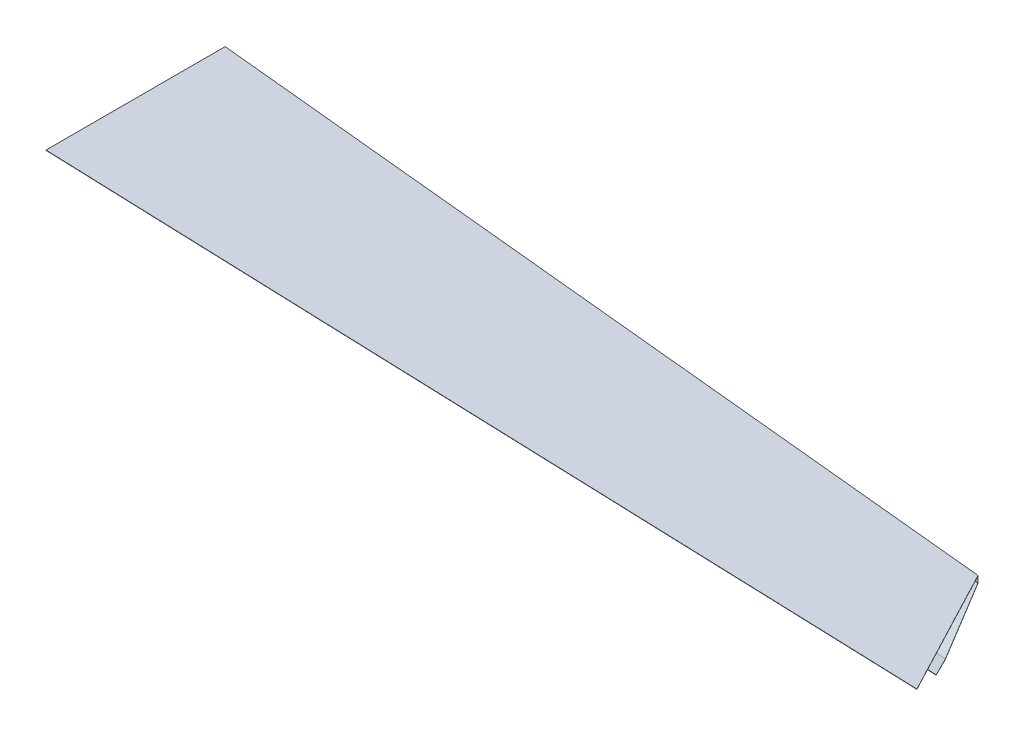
ISO-10303-21;
HEADER;
FILE_DESCRIPTION(('STEP AP214'),'2;1');
FILE_NAME('part.step','',(''),(''),'','','');
FILE_SCHEMA(('AUTOMOTIVE_DESIGN { 1 0 10303 214 1 1 1 1 }'));
ENDSEC;
DATA;
#1=APPLICATION_CONTEXT('core data for automotive mechanical design processes');
#2=APPLICATION_PROTOCOL_DEFINITION('international standard','automotive_design',2000,#1);
#3=PRODUCT_CONTEXT('',#1,'mechanical');
#4=PRODUCT('Part','Part','',(#3));
#5=PRODUCT_RELATED_PRODUCT_CATEGORY('part','',(#4));
#6=PRODUCT_DEFINITION_FORMATION('','',#4);
#7=PRODUCT_DEFINITION_CONTEXT('part definition',#1,'design');
#8=PRODUCT_DEFINITION('design','',#6,#7);
#9=PRODUCT_DEFINITION_SHAPE('','',#8);
#10=(LENGTH_UNIT() NAMED_UNIT(*) SI_UNIT(.MILLI.,.METRE.));
#11=(NAMED_UNIT(*) PLANE_ANGLE_UNIT() SI_UNIT($,.RADIAN.));
#12=(NAMED_UNIT(*) SI_UNIT($,.STERADIAN.) SOLID_ANGLE_UNIT());
#13=UNCERTAINTY_MEASURE_WITH_UNIT(LENGTH_MEASURE(1.E-05),#10,'distance_accuracy_value','');
#14=(GEOMETRIC_REPRESENTATION_CONTEXT(3) GLOBAL_UNCERTAINTY_ASSIGNED_CONTEXT((#13)) GLOBAL_UNIT_ASSIGNED_CONTEXT((#10,
#11,#12)) REPRESENTATION_CONTEXT('',''));
#15=CARTESIAN_POINT('',(0.,0.,0.));
#16=DIRECTION('',(0.,0.,1.));
#17=DIRECTION('',(1.,0.,0.));
#18=AXIS2_PLACEMENT_3D('',#15,#16,#17);
#19=CARTESIAN_POINT('',(-2552.7,0.,1.09982839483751E-12));
#20=DIRECTION('',(-1.,0.,0.));
#21=DIRECTION('',(0.,0.,1.));
#22=AXIS2_PLACEMENT_3D('',#19,#20,#21);
#23=PLANE('',#22);
#24=DIRECTION('',(0.,0.201372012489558,-0.979514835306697));
#25=VECTOR('',#24,1.);
#26=CARTESIAN_POINT('',(-2552.7,-349.90529063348,-71.9347272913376));
#27=LINE('',#26,#25);
#28=CARTESIAN_POINT('',(-2552.7,-161.69252197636,-987.44029737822));
#29=VERTEX_POINT('',#28);
#30=CARTESIAN_POINT('',(-2552.7,-38.1,-1588.61971308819));
#31=VERTEX_POINT('',#30);
#32=EDGE_CURVE('E219',#29,#31,#27,.T.);
#33=ORIENTED_EDGE('',*,*,#32,.F.);
#34=DIRECTION('',(0.,0.0535365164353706,0.998565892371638));
#35=VECTOR('',#34,1.);
#36=CARTESIAN_POINT('',(-2552.7,-108.44078468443,5.81387958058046));
#37=LINE('',#36,#35);
#38=CARTESIAN_POINT('',(-2552.7,-158.848765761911,-934.398408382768));
#39=VERTEX_POINT('',#38);
#40=EDGE_CURVE('E199',#29,#39,#37,.T.);
#41=ORIENTED_EDGE('',*,*,#40,.T.);
#42=DIRECTION('',(0.,0.998589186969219,-0.0531002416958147));
#43=VECTOR('',#42,1.);
#44=CARTESIAN_POINT('',(-2552.7,-123.400309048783,-936.283389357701));
#45=LINE('',#44,#43);
#46=CARTESIAN_POINT('',(-2552.7,-157.225418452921,-934.484730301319));
#47=VERTEX_POINT('',#46);
#48=EDGE_CURVE('E196',#39,#47,#45,.T.);
#49=ORIENTED_EDGE('',*,*,#48,.T.);
#50=DIRECTION('',(0.,0.0535365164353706,0.998565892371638));
#51=VECTOR('',#50,1.);
#52=CARTESIAN_POINT('',(-2552.7,-106.817475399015,5.72684844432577));
#53=LINE('',#52,#51);
#54=CARTESIAN_POINT('',(-2552.7,-160.057939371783,-987.317057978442));
#55=VERTEX_POINT('',#54);
#56=EDGE_CURVE('E226',#55,#47,#53,.T.);
#57=ORIENTED_EDGE('',*,*,#56,.F.);
#58=DIRECTION('',(0.,0.201372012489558,-0.979514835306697));
#59=VECTOR('',#58,1.);
#60=CARTESIAN_POINT('',(-2552.7,-348.312682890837,-71.6073135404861));
#61=LINE('',#60,#59);
#62=CARTESIAN_POINT('',(-2552.7,-36.7758705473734,-1586.98636578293));
#63=VERTEX_POINT('',#62);
#64=EDGE_CURVE('E190',#55,#63,#61,.T.);
#65=ORIENTED_EDGE('',*,*,#64,.T.);
#66=DIRECTION('',(0.,1.,0.));
#67=VECTOR('',#66,1.);
#68=CARTESIAN_POINT('',(-2552.7,-19.0500000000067,-1586.98636578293));
#69=LINE('',#68,#67);
#70=CARTESIAN_POINT('',(-2552.7,-1.62560000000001,-1586.98636578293));
#71=VERTEX_POINT('',#70);
#72=EDGE_CURVE('E174',#63,#71,#69,.T.);
#73=ORIENTED_EDGE('',*,*,#72,.T.);
#74=DIRECTION('',(0.,0.,1.));
#75=VECTOR('',#74,1.);
#76=CARTESIAN_POINT('',(-2552.7,-1.62560000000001,1.09982839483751E-12));
#77=LINE('',#76,#75);
#78=CARTESIAN_POINT('',(-2552.7,-1.62560000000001,-576.950850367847));
#79=VERTEX_POINT('',#78);
#80=EDGE_CURVE('E188',#71,#79,#77,.T.);
#81=ORIENTED_EDGE('',*,*,#80,.T.);
#82=DIRECTION('',(0.,-1.,0.));
#83=VECTOR('',#82,1.);
#84=CARTESIAN_POINT('',(-2552.7,-1.62559999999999,-576.950850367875));
#85=LINE('',#84,#83);
#86=CARTESIAN_POINT('',(-2552.7,0.,-576.950850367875));
#87=VERTEX_POINT('',#86);
#88=EDGE_CURVE('E191',#87,#79,#85,.T.);
#89=ORIENTED_EDGE('',*,*,#88,.F.);
#90=DIRECTION('',(0.,0.,1.));
#91=VECTOR('',#90,1.);
#92=CARTESIAN_POINT('',(-2552.7,0.,1.09982839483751E-12));
#93=LINE('',#92,#91);
#94=CARTESIAN_POINT('',(-2552.7,0.,-1588.61971308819));
#95=VERTEX_POINT('',#94);
#96=EDGE_CURVE('E228',#95,#87,#93,.T.);
#97=ORIENTED_EDGE('',*,*,#96,.F.);
#98=DIRECTION('',(0.,1.,0.));
#99=VECTOR('',#98,1.);
#100=CARTESIAN_POINT('',(-2552.7,-1.62560000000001,-1588.61971308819));
#101=LINE('',#100,#99);
#102=EDGE_CURVE('E232',#31,#95,#101,.T.);
#103=ORIENTED_EDGE('',*,*,#102,.F.);
#104=EDGE_LOOP('',(#33,#41,#49,#57,#65,#73,#81,#89,#97,#103));
#105=FACE_BOUND('',#104,.T.);
#106=ADVANCED_FACE('F90',(#105),#23,.T.);
#107=CARTESIAN_POINT('',(2571.71966629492,-1.62559999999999,-398.82639715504));
#108=DIRECTION('',(-0.0347389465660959,0.,0.999396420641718));
#109=DIRECTION('',(0.999396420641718,0.,0.0347389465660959));
#110=AXIS2_PLACEMENT_3D('',#107,#108,#109);
#111=PLANE('',#110);
#112=DIRECTION('',(0.999396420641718,0.,0.0347389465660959));
#113=VECTOR('',#112,1.);
#114=CARTESIAN_POINT('',(2571.71966629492,0.,-398.82639715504));
#115=LINE('',#114,#113);
#116=CARTESIAN_POINT('',(2542.48326093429,0.,-399.842652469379));
#117=VERTEX_POINT('',#116);
#118=EDGE_CURVE('E182',#87,#117,#115,.T.);
#119=ORIENTED_EDGE('',*,*,#118,.F.);
#120=ORIENTED_EDGE('',*,*,#88,.T.);
#121=DIRECTION('',(0.999396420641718,0.,0.0347389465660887));
#122=VECTOR('',#121,1.);
#123=CARTESIAN_POINT('',(-2552.7,-1.62560000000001,-576.950850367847));
#124=LINE('',#123,#122);
#125=CARTESIAN_POINT('',(2542.48326093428,-1.62559999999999,-399.842652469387));
#126=VERTEX_POINT('',#125);
#127=EDGE_CURVE('E194',#79,#126,#124,.T.);
#128=ORIENTED_EDGE('',*,*,#127,.T.);
#129=DIRECTION('',(0.,-1.,0.));
#130=VECTOR('',#129,1.);
#131=CARTESIAN_POINT('',(2542.48326093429,-1.62559999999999,-399.842652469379));
#132=LINE('',#131,#130);
#133=EDGE_CURVE('E255',#117,#126,#132,.T.);
#134=ORIENTED_EDGE('',*,*,#133,.F.);
#135=EDGE_LOOP('',(#119,#120,#128,#134));
#136=FACE_BOUND('',#135,.T.);
#137=ADVANCED_FACE('F241',(#136),#111,.T.);
#138=CARTESIAN_POINT('',(-2578.1,0.,-1591.10246902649));
#139=CARTESIAN_POINT('',(-2578.1,-12.7,-1591.10246902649));
#140=CARTESIAN_POINT('',(-2578.1,-25.4,-1591.10246902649));
#141=CARTESIAN_POINT('',(-2578.1,-38.1,-1591.10246902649));
#142=CARTESIAN_POINT('',(-988.874596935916,0.,-1435.76157112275));
#143=CARTESIAN_POINT('',(-988.874596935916,-12.7,-1435.76157112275));
#144=CARTESIAN_POINT('',(-988.874596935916,-25.4,-1435.76157112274));
#145=CARTESIAN_POINT('',(-988.874596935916,-38.1,-1435.76157112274));
#146=CARTESIAN_POINT('',(600.35080612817,0.,-1280.420673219));
#147=CARTESIAN_POINT('',(600.35080612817,-12.7,-1280.420673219));
#148=CARTESIAN_POINT('',(600.35080612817,-25.4,-1280.420673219));
#149=CARTESIAN_POINT('',(600.35080612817,-38.1,-1280.420673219));
#150=CARTESIAN_POINT('',(2189.57620919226,0.,-1125.07977531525));
#151=CARTESIAN_POINT('',(2189.57620919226,-12.7,-1125.07977531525));
#152=CARTESIAN_POINT('',(2189.57620919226,-25.4,-1125.07977531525));
#153=CARTESIAN_POINT('',(2189.57620919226,-38.1000000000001,-1125.07977531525));
#154=B_SPLINE_SURFACE_WITH_KNOTS('',3,3,((#138,#139,#140,#141),(#142,#143,#144,#145),(#146,#147,
#148,#149),(#150,#151,#152,#153)),.UNSPECIFIED.,.F.,.F.,.F.,(4,4),(4,4),(0.,1.),(0.,1.),.UNSPECIFIED.);
#155=OFFSET_SURFACE('',#154,-1.6256,.F.);
#156=ORIENTED_EDGE('',*,*,#72,.F.);
#157=DIRECTION('',(-0.995256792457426,0.,-0.0972826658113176));
#158=VECTOR('',#157,1.);
#159=CARTESIAN_POINT('',(-194.420038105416,-36.7758705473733,-1356.47323272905));
#160=LINE('',#159,#158);
#161=CARTESIAN_POINT('',(2160.22434111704,-36.7758705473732,-1126.31546441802));
#162=VERTEX_POINT('',#161);
#163=EDGE_CURVE('E205',#162,#63,#160,.T.);
#164=ORIENTED_EDGE('',*,*,#163,.F.);
#165=DIRECTION('',(0.,1.,0.));
#166=VECTOR('',#165,1.);
#167=CARTESIAN_POINT('',(2160.22434111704,-19.0499999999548,-1126.31546441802));
#168=LINE('',#167,#166);
#169=CARTESIAN_POINT('',(2160.22434111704,-1.62559999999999,-1126.31546441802));
#170=VERTEX_POINT('',#169);
#171=EDGE_CURVE('E177',#162,#170,#168,.T.);
#172=ORIENTED_EDGE('',*,*,#171,.T.);
#173=DIRECTION('',(-0.995256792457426,0.,-0.0972826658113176));
#174=VECTOR('',#173,1.);
#175=CARTESIAN_POINT('',(129.495437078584,-1.6256,-1324.81169455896));
#176=LINE('',#175,#174);
#177=EDGE_CURVE('E170',#170,#71,#176,.T.);
#178=ORIENTED_EDGE('',*,*,#177,.T.);
#179=EDGE_LOOP('',(#156,#164,#172,#178));
#180=FACE_BOUND('',#179,.T.);
#181=ADVANCED_FACE('F172',(#180),#155,.F.);
#182=CARTESIAN_POINT('',(-2552.7,-1.62560000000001,-1588.61971308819));
#183=DIRECTION('',(0.0972826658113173,0.,-0.995256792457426));
#184=DIRECTION('',(-0.995256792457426,0.,-0.0972826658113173));
#185=AXIS2_PLACEMENT_3D('',#182,#183,#184);
#186=PLANE('',#185);
#187=DIRECTION('',(-0.995256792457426,0.,-0.0972826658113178));
#188=VECTOR('',#187,1.);
#189=CARTESIAN_POINT('',(-194.261895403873,-38.1,-1358.09112217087));
#190=LINE('',#189,#188);
#191=CARTESIAN_POINT('',(2159.3182985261,-38.1000000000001,-1128.03737403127));
#192=VERTEX_POINT('',#191);
#193=EDGE_CURVE('E181',#192,#31,#190,.T.);
#194=ORIENTED_EDGE('',*,*,#193,.T.);
#195=ORIENTED_EDGE('',*,*,#102,.T.);
#196=DIRECTION('',(-0.995256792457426,0.,-0.0972826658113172));
#197=VECTOR('',#196,1.);
#198=CARTESIAN_POINT('',(-2552.7,0.,-1588.61971308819));
#199=LINE('',#198,#197);
#200=CARTESIAN_POINT('',(2159.3182985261,0.,-1128.03737403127));
#201=VERTEX_POINT('',#200);
#202=EDGE_CURVE('E208',#201,#95,#199,.T.);
#203=ORIENTED_EDGE('',*,*,#202,.F.);
#204=DIRECTION('',(0.,1.,0.));
#205=VECTOR('',#204,1.);
#206=CARTESIAN_POINT('',(2159.3182985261,-1.62560000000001,-1128.03737403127));
#207=LINE('',#206,#205);
#208=EDGE_CURVE('E259',#192,#201,#207,.T.);
#209=ORIENTED_EDGE('',*,*,#208,.F.);
#210=EDGE_LOOP('',(#194,#195,#203,#209));
#211=FACE_BOUND('',#210,.T.);
#212=ADVANCED_FACE('F247',(#211),#186,.T.);
#213=CARTESIAN_POINT('',(6.00801669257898,-298.980404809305,-61.465414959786));
#214=DIRECTION('',(0.0196795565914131,-0.979325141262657,-0.201333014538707));
#215=DIRECTION('',(0.,0.201372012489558,-0.979514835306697));
#216=AXIS2_PLACEMENT_3D('',#213,#214,#215);
#217=PLANE('',#216);
#218=ORIENTED_EDGE('',*,*,#64,.F.);
#219=DIRECTION('',(0.998694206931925,0.00975957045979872,0.0501461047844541));
#220=VECTOR('',#219,1.);
#221=CARTESIAN_POINT('',(44.343268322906,-134.678772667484,-856.915176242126));
#222=LINE('',#221,#220);
#223=CARTESIAN_POINT('',(2363.24549091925,-112.017692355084,-740.479221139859));
#224=VERTEX_POINT('',#223);
#225=EDGE_CURVE('E203',#55,#224,#222,.T.);
#226=ORIENTED_EDGE('',*,*,#225,.T.);
#227=DIRECTION('',(-0.458872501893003,0.170063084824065,-0.872074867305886));
#228=VECTOR('',#227,1.);
#229=CARTESIAN_POINT('',(2153.20801680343,-34.1755452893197,-1139.64980035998));
#230=LINE('',#229,#228);
#231=EDGE_CURVE('E262',#224,#162,#230,.T.);
#232=ORIENTED_EDGE('',*,*,#231,.T.);
#233=ORIENTED_EDGE('',*,*,#163,.T.);
#234=EDGE_LOOP('',(#218,#226,#232,#233));
#235=FACE_BOUND('',#234,.T.);
#236=ADVANCED_FACE('F275',(#235),#217,.F.);
#237=CARTESIAN_POINT('',(6.04000777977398,-300.572395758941,-61.7927019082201));
#238=DIRECTION('',(0.0196795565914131,-0.979325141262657,-0.201333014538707));
#239=DIRECTION('',(0.,0.201372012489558,-0.979514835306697));
#240=AXIS2_PLACEMENT_3D('',#237,#238,#239);
#241=PLANE('',#240);
#242=DIRECTION('',(0.998694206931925,0.00975957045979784,0.0501461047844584));
#243=VECTOR('',#242,1.);
#244=CARTESIAN_POINT('',(2390.23378072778,-113.38853645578,-739.247333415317));
#245=LINE('',#244,#243);
#246=CARTESIAN_POINT('',(2363.17888444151,-113.652925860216,-740.605804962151));
#247=VERTEX_POINT('',#246);
#248=EDGE_CURVE('E212',#29,#247,#245,.T.);
#249=ORIENTED_EDGE('',*,*,#248,.F.);
#250=ORIENTED_EDGE('',*,*,#32,.T.);
#251=ORIENTED_EDGE('',*,*,#193,.F.);
#252=DIRECTION('',(-0.458872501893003,0.170063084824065,-0.872074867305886));
#253=VECTOR('',#252,1.);
#254=CARTESIAN_POINT('',(2153.07848128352,-35.7874566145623,-1139.89597913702));
#255=LINE('',#254,#253);
#256=EDGE_CURVE('E256',#247,#192,#255,.T.);
#257=ORIENTED_EDGE('',*,*,#256,.F.);
#258=EDGE_LOOP('',(#249,#250,#251,#257));
#259=FACE_BOUND('',#258,.T.);
#260=ADVANCED_FACE('F277',(#259),#241,.T.);
#261=CARTESIAN_POINT('',(0.628667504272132,-88.79092593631,4.7603837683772));
#262=DIRECTION('',(-0.00706998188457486,0.998540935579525,-0.0535351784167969));
#263=DIRECTION('',(0.,0.0535365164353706,0.998565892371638));
#264=AXIS2_PLACEMENT_3D('',#261,#262,#263);
#265=PLANE('',#264);
#266=ORIENTED_EDGE('',*,*,#225,.F.);
#267=ORIENTED_EDGE('',*,*,#56,.T.);
#268=DIRECTION('',(-0.998071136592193,-0.010348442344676,-0.0612120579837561));
#269=VECTOR('',#268,1.);
#270=CARTESIAN_POINT('',(2449.08549602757,-105.364697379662,-627.723445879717));
#271=LINE('',#270,#269);
#272=CARTESIAN_POINT('',(2421.69183764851,-105.648726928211,-629.403508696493));
#273=VERTEX_POINT('',#272);
#274=EDGE_CURVE('E13',#273,#47,#271,.T.);
#275=ORIENTED_EDGE('',*,*,#274,.F.);
#276=DIRECTION('',(0.465057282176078,0.050677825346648,0.883828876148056));
#277=VECTOR('',#276,1.);
#278=CARTESIAN_POINT('',(2159.12682983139,-134.260736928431,-1128.40125514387));
#279=LINE('',#278,#277);
#280=EDGE_CURVE('E230',#224,#273,#279,.T.);
#281=ORIENTED_EDGE('',*,*,#280,.F.);
#282=EDGE_LOOP('',(#266,#267,#275,#281));
#283=FACE_BOUND('',#282,.T.);
#284=ADVANCED_FACE('F227',(#283),#265,.T.);
#285=CARTESIAN_POINT('',(0.640160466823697,-90.4141540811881,4.84741055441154));
#286=DIRECTION('',(-0.00706998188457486,0.998540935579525,-0.0535351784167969));
#287=DIRECTION('',(0.,0.0535365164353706,0.998565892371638));
#288=AXIS2_PLACEMENT_3D('',#285,#286,#287);
#289=PLANE('',#288);
#290=ORIENTED_EDGE('',*,*,#40,.F.);
#291=ORIENTED_EDGE('',*,*,#248,.T.);
#292=DIRECTION('',(0.465057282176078,0.050677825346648,0.883828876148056));
#293=VECTOR('',#292,1.);
#294=CARTESIAN_POINT('',(2159.16519810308,-135.884531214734,-1128.32833727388));
#295=LINE('',#294,#293);
#296=CARTESIAN_POINT('',(2421.73877360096,-107.271587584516,-629.314308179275));
#297=VERTEX_POINT('',#296);
#298=EDGE_CURVE('E115',#247,#297,#295,.T.);
#299=ORIENTED_EDGE('',*,*,#298,.T.);
#300=DIRECTION('',(-0.998071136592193,-0.010348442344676,-0.0612120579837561));
#301=VECTOR('',#300,1.);
#302=CARTESIAN_POINT('',(2449.09698899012,-106.98792552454,-627.636419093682));
#303=LINE('',#302,#301);
#304=EDGE_CURVE('E101',#297,#39,#303,.T.);
#305=ORIENTED_EDGE('',*,*,#304,.T.);
#306=EDGE_LOOP('',(#290,#291,#299,#305));
#307=FACE_BOUND('',#306,.T.);
#308=ADVANCED_FACE('F216',(#307),#289,.F.);
#309=CARTESIAN_POINT('',(2449.09698899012,-106.98792552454,-627.636419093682));
#310=DIRECTION('',(0.0616767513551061,-0.0529991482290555,-0.996688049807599));
#311=DIRECTION('',(-0.998090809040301,0.,-0.0617635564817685));
#312=AXIS2_PLACEMENT_3D('',#309,#310,#311);
#313=PLANE('',#312);
#314=ORIENTED_EDGE('',*,*,#48,.F.);
#315=ORIENTED_EDGE('',*,*,#304,.F.);
#316=DIRECTION('',(-0.0288661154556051,0.998076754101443,-0.0548592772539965));
#317=VECTOR('',#316,1.);
#318=CARTESIAN_POINT('',(2421.75605449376,-107.869092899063,-629.281466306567));
#319=LINE('',#318,#317);
#320=EDGE_CURVE('E107',#297,#273,#319,.T.);
#321=ORIENTED_EDGE('',*,*,#320,.T.);
#322=ORIENTED_EDGE('',*,*,#274,.T.);
#323=EDGE_LOOP('',(#314,#315,#321,#322));
#324=FACE_BOUND('',#323,.T.);
#325=ADVANCED_FACE('F220',(#324),#313,.F.);
#326=CARTESIAN_POINT('',(0.,0.,0.));
#327=DIRECTION('',(0.,1.,0.));
#328=DIRECTION('',(-1.,0.,0.));
#329=AXIS2_PLACEMENT_3D('',#326,#327,#328);
#330=PLANE('',#329);
#331=ORIENTED_EDGE('',*,*,#202,.T.);
#332=ORIENTED_EDGE('',*,*,#96,.T.);
#333=ORIENTED_EDGE('',*,*,#118,.T.);
#334=DIRECTION('',(0.465655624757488,0.,0.884966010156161));
#335=VECTOR('',#334,1.);
#336=CARTESIAN_POINT('',(2155.9544129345,0.,-1134.43034826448));
#337=LINE('',#336,#335);
#338=EDGE_CURVE('E251',#201,#117,#337,.T.);
#339=ORIENTED_EDGE('',*,*,#338,.F.);
#340=EDGE_LOOP('',(#331,#332,#333,#339));
#341=FACE_BOUND('',#340,.T.);
#342=ADVANCED_FACE('F249',(#341),#330,.T.);
#343=CARTESIAN_POINT('',(0.,-1.6256,0.));
#344=DIRECTION('',(0.,1.,0.));
#345=DIRECTION('',(-1.,0.,0.));
#346=AXIS2_PLACEMENT_3D('',#343,#344,#345);
#347=PLANE('',#346);
#348=ORIENTED_EDGE('',*,*,#80,.F.);
#349=ORIENTED_EDGE('',*,*,#177,.F.);
#350=DIRECTION('',(0.465655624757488,0.,0.884966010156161));
#351=VECTOR('',#350,1.);
#352=CARTESIAN_POINT('',(2155.9544129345,-1.62559999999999,-1134.43034826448));
#353=LINE('',#352,#351);
#354=EDGE_CURVE('E270',#170,#126,#353,.T.);
#355=ORIENTED_EDGE('',*,*,#354,.T.);
#356=ORIENTED_EDGE('',*,*,#127,.F.);
#357=EDGE_LOOP('',(#348,#349,#355,#356));
#358=FACE_BOUND('',#357,.T.);
#359=ADVANCED_FACE('F193',(#358),#347,.F.);
#360=CARTESIAN_POINT('',(2155.9544129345,0.,-1134.43034826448));
#361=DIRECTION('',(-0.884966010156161,0.,0.465655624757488));
#362=DIRECTION('',(0.465655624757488,0.,0.884966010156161));
#363=AXIS2_PLACEMENT_3D('',#360,#361,#362);
#364=PLANE('',#363);
#365=ORIENTED_EDGE('',*,*,#171,.F.);
#366=ORIENTED_EDGE('',*,*,#231,.F.);
#367=ORIENTED_EDGE('',*,*,#280,.T.);
#368=ORIENTED_EDGE('',*,*,#320,.F.);
#369=ORIENTED_EDGE('',*,*,#298,.F.);
#370=ORIENTED_EDGE('',*,*,#256,.T.);
#371=ORIENTED_EDGE('',*,*,#208,.T.);
#372=ORIENTED_EDGE('',*,*,#338,.T.);
#373=ORIENTED_EDGE('',*,*,#133,.T.);
#374=ORIENTED_EDGE('',*,*,#354,.F.);
#375=EDGE_LOOP('',(#365,#366,#367,#368,#369,#370,#371,#372,#373,#374));
#376=FACE_BOUND('',#375,.T.);
#377=ADVANCED_FACE('F260',(#376),#364,.F.);
#378=CLOSED_SHELL('',(#106,#137,#181,#212,#236,#260,#284,#308,#325,#342,#359,#377));
#379=MANIFOLD_SOLID_BREP('B2',#378);
#380=ADVANCED_BREP_SHAPE_REPRESENTATION('',(#18,#379),#14);
#381=SHAPE_DEFINITION_REPRESENTATION(#9,#380);
ENDSEC;
END-ISO-10303-21;
